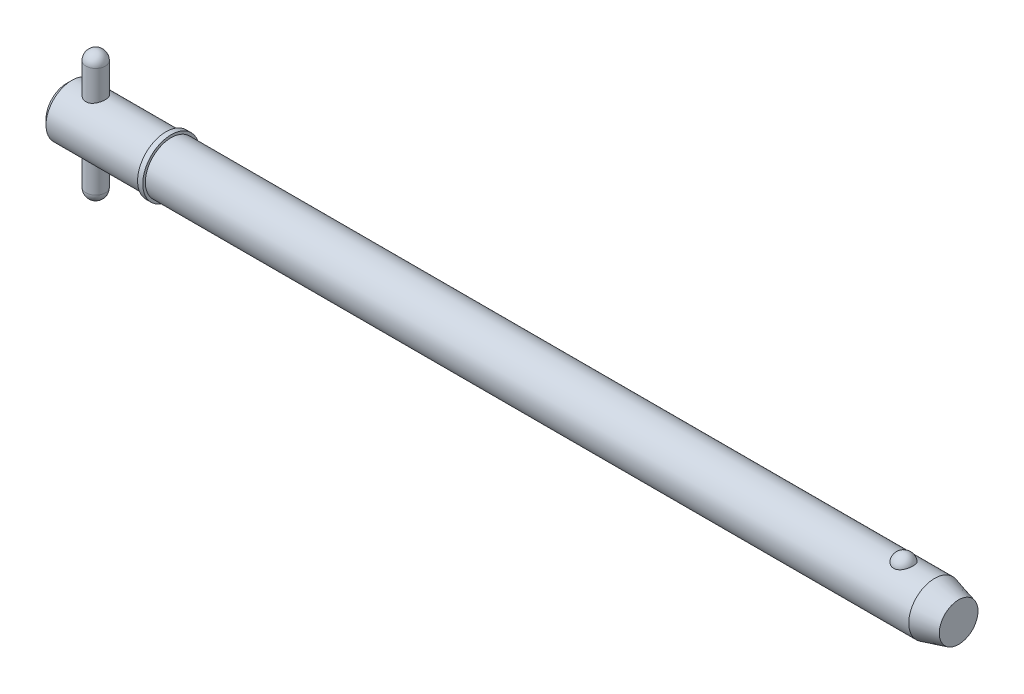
ISO-10303-21;
HEADER;
FILE_DESCRIPTION(('STEP AP214'),'2;1');
FILE_NAME('part.step','',(''),(''),'','','');
FILE_SCHEMA(('AUTOMOTIVE_DESIGN { 1 0 10303 214 1 1 1 1 }'));
ENDSEC;
DATA;
#1=APPLICATION_CONTEXT('core data for automotive mechanical design processes');
#2=APPLICATION_PROTOCOL_DEFINITION('international standard','automotive_design',2000,#1);
#3=PRODUCT_CONTEXT('',#1,'mechanical');
#4=PRODUCT('Part','Part','',(#3));
#5=PRODUCT_RELATED_PRODUCT_CATEGORY('part','',(#4));
#6=PRODUCT_DEFINITION_FORMATION('','',#4);
#7=PRODUCT_DEFINITION_CONTEXT('part definition',#1,'design');
#8=PRODUCT_DEFINITION('design','',#6,#7);
#9=PRODUCT_DEFINITION_SHAPE('','',#8);
#10=(LENGTH_UNIT() NAMED_UNIT(*) SI_UNIT(.MILLI.,.METRE.));
#11=(NAMED_UNIT(*) PLANE_ANGLE_UNIT() SI_UNIT($,.RADIAN.));
#12=(NAMED_UNIT(*) SI_UNIT($,.STERADIAN.) SOLID_ANGLE_UNIT());
#13=UNCERTAINTY_MEASURE_WITH_UNIT(LENGTH_MEASURE(1.E-05),#10,'distance_accuracy_value','');
#14=(GEOMETRIC_REPRESENTATION_CONTEXT(3) GLOBAL_UNCERTAINTY_ASSIGNED_CONTEXT((#13)) GLOBAL_UNIT_ASSIGNED_CONTEXT((#10,
#11,#12)) REPRESENTATION_CONTEXT('',''));
#15=CARTESIAN_POINT('',(0.,0.,0.));
#16=DIRECTION('',(0.,0.,1.));
#17=DIRECTION('',(1.,0.,0.));
#18=AXIS2_PLACEMENT_3D('',#15,#16,#17);
#19=CARTESIAN_POINT('',(7.14,15.875,0.));
#20=DIRECTION('',(0.,-1.,0.));
#21=DIRECTION('',(0.,0.,-1.));
#22=AXIS2_PLACEMENT_3D('',#19,#20,#21);
#23=CYLINDRICAL_SURFACE('',#22,2.38);
#24=CARTESIAN_POINT('',(7.14,-13.495,0.));
#25=DIRECTION('',(0.,-1.,0.));
#26=DIRECTION('',(0.,0.,-1.));
#27=AXIS2_PLACEMENT_3D('',#24,#25,#26);
#28=CIRCLE('',#27,2.38);
#29=CARTESIAN_POINT('',(7.14,-13.495,-2.38));
#30=VERTEX_POINT('',#29);
#31=EDGE_CURVE('P0_E10',#30,#30,#28,.F.);
#32=ORIENTED_EDGE('',*,*,#31,.T.);
#33=EDGE_LOOP('',(#32));
#34=FACE_BOUND('',#33,.T.);
#35=CARTESIAN_POINT('',(7.14,13.495,0.));
#36=DIRECTION('',(0.,-1.,0.));
#37=DIRECTION('',(0.,0.,-1.));
#38=AXIS2_PLACEMENT_3D('',#35,#36,#37);
#39=CIRCLE('',#38,2.38);
#40=CARTESIAN_POINT('',(7.14,13.495,-2.38));
#41=VERTEX_POINT('',#40);
#42=EDGE_CURVE('P0_E21',#41,#41,#39,.T.);
#43=ORIENTED_EDGE('',*,*,#42,.T.);
#44=EDGE_LOOP('',(#43));
#45=FACE_BOUND('',#44,.T.);
#46=ADVANCED_FACE('P0_F14',(#34,#45),#23,.T.);
#47=CARTESIAN_POINT('',(7.14,-13.495,0.));
#48=DIRECTION('',(0.,0.,1.));
#49=DIRECTION('',(1.,0.,0.));
#50=AXIS2_PLACEMENT_3D('',#47,#48,#49);
#51=SPHERICAL_SURFACE('',#50,2.38);
#52=CARTESIAN_POINT('',(7.14,-13.495,0.));
#53=DIRECTION('',(0.,-1.,0.));
#54=DIRECTION('',(0.,0.,-1.));
#55=AXIS2_PLACEMENT_3D('',#52,#53,#54);
#56=SPHERICAL_SURFACE('',#55,2.38);
#57=ORIENTED_EDGE('',*,*,#31,.F.);
#58=EDGE_LOOP('',(#57));
#59=FACE_BOUND('',#58,.T.);
#60=ADVANCED_FACE('P0_F29',(#59),#56,.T.);
#61=CARTESIAN_POINT('',(7.14,13.495,0.));
#62=DIRECTION('',(0.,0.,1.));
#63=DIRECTION('',(1.,0.,0.));
#64=AXIS2_PLACEMENT_3D('',#61,#62,#63);
#65=SPHERICAL_SURFACE('',#64,2.38);
#66=CARTESIAN_POINT('',(7.14,13.495,0.));
#67=DIRECTION('',(0.,-1.,0.));
#68=DIRECTION('',(0.,0.,-1.));
#69=AXIS2_PLACEMENT_3D('',#66,#67,#68);
#70=SPHERICAL_SURFACE('',#69,2.38);
#71=ORIENTED_EDGE('',*,*,#42,.F.);
#72=EDGE_LOOP('',(#71));
#73=FACE_BOUND('',#72,.T.);
#74=ADVANCED_FACE('P0_F16',(#73),#70,.T.);
#75=CLOSED_SHELL('',(#46,#60,#74));
#76=MANIFOLD_SOLID_BREP('P0_B1',#75);
#77=CARTESIAN_POINT('',(0.,0.,0.));
#78=DIRECTION('',(1.,0.,0.));
#79=DIRECTION('',(0.,0.,-1.));
#80=AXIS2_PLACEMENT_3D('',#77,#78,#79);
#81=CYLINDRICAL_SURFACE('',#80,6.35);
#82=CARTESIAN_POINT('',(213.455369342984,0.,0.));
#83=DIRECTION('',(1.,0.,0.));
#84=DIRECTION('',(0.,0.,-1.));
#85=AXIS2_PLACEMENT_3D('',#82,#83,#84);
#86=CIRCLE('',#85,6.35);
#87=CARTESIAN_POINT('',(213.455369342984,0.,-6.35));
#88=VERTEX_POINT('',#87);
#89=EDGE_CURVE('P1_E81',#88,#88,#86,.T.);
#90=ORIENTED_EDGE('',*,*,#89,.F.);
#91=EDGE_LOOP('',(#90));
#92=FACE_BOUND('',#91,.T.);
#93=CARTESIAN_POINT('',(25.7,0.,0.));
#94=DIRECTION('',(1.,0.,0.));
#95=DIRECTION('',(0.,0.,-1.));
#96=AXIS2_PLACEMENT_3D('',#93,#94,#95);
#97=CIRCLE('',#96,6.35);
#98=CARTESIAN_POINT('',(25.7,0.,-6.35));
#99=VERTEX_POINT('',#98);
#100=EDGE_CURVE('P1_E85',#99,#99,#97,.T.);
#101=ORIENTED_EDGE('',*,*,#100,.T.);
#102=EDGE_LOOP('',(#101));
#103=FACE_BOUND('',#102,.T.);
#104=CARTESIAN_POINT('',(205.830021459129,5.87502187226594,2.40969251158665));
#105=CARTESIAN_POINT('',(205.705030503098,5.87501645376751,2.40969773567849));
#106=CARTESIAN_POINT('',(205.580080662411,5.87916061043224,2.39967292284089));
#107=CARTESIAN_POINT('',(205.333909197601,5.89523112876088,2.35991730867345));
#108=CARTESIAN_POINT('',(205.212686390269,5.90715499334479,2.33019283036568));
#109=CARTESIAN_POINT('',(204.977517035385,5.93739567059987,2.25201402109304));
#110=CARTESIAN_POINT('',(204.863560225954,5.95570321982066,2.20358681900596));
#111=CARTESIAN_POINT('',(204.64557352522,5.99672067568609,2.08937987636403));
#112=CARTESIAN_POINT('',(204.541545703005,6.0194314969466,2.02359652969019));
#113=CARTESIAN_POINT('',(204.342943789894,6.06760647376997,1.87428969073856));
#114=CARTESIAN_POINT('',(204.248726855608,6.09313095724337,1.79031110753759));
#115=CARTESIAN_POINT('',(204.075255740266,6.14375873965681,1.6080017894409));
#116=CARTESIAN_POINT('',(203.996004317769,6.16886196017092,1.50966841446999));
#117=CARTESIAN_POINT('',(203.850845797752,6.21724600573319,1.29645884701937));
#118=CARTESIAN_POINT('',(203.785688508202,6.24039621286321,1.1810415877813));
#119=CARTESIAN_POINT('',(203.674703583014,6.28117277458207,0.940351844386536));
#120=CARTESIAN_POINT('',(203.628877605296,6.29879865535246,0.815078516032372));
#121=CARTESIAN_POINT('',(203.557023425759,6.32692073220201,0.556494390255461));
#122=CARTESIAN_POINT('',(203.531249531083,6.33732517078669,0.423102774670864));
#123=CARTESIAN_POINT('',(203.500988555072,6.34957673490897,0.153542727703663));
#124=CARTESIAN_POINT('',(203.496500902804,6.35142408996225,0.0173743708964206));
#125=CARTESIAN_POINT('',(203.508865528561,6.34638925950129,-0.253036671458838));
#126=CARTESIAN_POINT('',(203.525594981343,6.33955731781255,-0.387285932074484));
#127=CARTESIAN_POINT('',(203.579843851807,6.31794129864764,-0.650851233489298));
#128=CARTESIAN_POINT('',(203.617363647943,6.3031570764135,-0.780167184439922));
#129=CARTESIAN_POINT('',(203.712500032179,6.26711642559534,-1.03041949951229));
#130=CARTESIAN_POINT('',(203.770143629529,6.24585130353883,-1.15134433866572));
#131=CARTESIAN_POINT('',(203.904352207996,6.19905619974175,-1.38129800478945));
#132=CARTESIAN_POINT('',(203.980918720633,6.17352587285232,-1.49032586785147));
#133=CARTESIAN_POINT('',(204.151753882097,6.12080227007,-1.69393164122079));
#134=CARTESIAN_POINT('',(204.246100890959,6.09360200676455,-1.78844209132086));
#135=CARTESIAN_POINT('',(204.450119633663,6.04070434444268,-1.95970536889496));
#136=CARTESIAN_POINT('',(204.559790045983,6.015006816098,-2.0364597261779));
#137=CARTESIAN_POINT('',(204.789187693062,5.96867714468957,-2.16845644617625));
#138=CARTESIAN_POINT('',(204.908652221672,5.94794910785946,-2.22412062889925));
#139=CARTESIAN_POINT('',(205.156218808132,5.91340580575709,-2.31440992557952));
#140=CARTESIAN_POINT('',(205.284317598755,5.89958794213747,-2.34904294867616));
#141=CARTESIAN_POINT('',(205.538582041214,5.88111049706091,-2.39491590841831));
#142=CARTESIAN_POINT('',(205.664520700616,5.87602512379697,-2.40724512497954));
#143=CARTESIAN_POINT('',(205.916786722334,5.87428980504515,-2.41147867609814));
#144=CARTESIAN_POINT('',(206.043114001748,5.8776381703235,-2.40338710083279));
#145=CARTESIAN_POINT('',(206.288417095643,5.89212921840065,-2.36762715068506));
#146=CARTESIAN_POINT('',(206.407499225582,5.90302431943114,-2.3405803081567));
#147=CARTESIAN_POINT('',(206.63924472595,5.93113752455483,-2.26839066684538));
#148=CARTESIAN_POINT('',(206.751907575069,5.94835614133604,-2.22324640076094));
#149=CARTESIAN_POINT('',(206.970400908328,5.9877301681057,-2.11493806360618));
#150=CARTESIAN_POINT('',(207.076028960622,6.00998499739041,-2.0514026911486));
#151=CARTESIAN_POINT('',(207.275300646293,6.05690144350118,-1.90842705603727));
#152=CARTESIAN_POINT('',(207.368941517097,6.08156361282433,-1.82898313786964));
#153=CARTESIAN_POINT('',(207.546675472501,6.13211715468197,-1.65182429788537));
#154=CARTESIAN_POINT('',(207.630055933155,6.15800825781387,-1.5533938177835));
#155=CARTESIAN_POINT('',(207.779790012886,6.20712834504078,-1.34374214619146));
#156=CARTESIAN_POINT('',(207.846140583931,6.23035685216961,-1.23251867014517));
#157=CARTESIAN_POINT('',(207.962345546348,6.27251177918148,-0.996447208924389));
#158=CARTESIAN_POINT('',(208.011607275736,6.29127762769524,-0.871278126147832));
#159=CARTESIAN_POINT('',(208.089614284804,6.3215862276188,-0.613870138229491));
#160=CARTESIAN_POINT('',(208.118359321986,6.33312889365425,-0.481631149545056));
#161=CARTESIAN_POINT('',(208.154770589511,6.34782349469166,-0.213672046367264));
#162=CARTESIAN_POINT('',(208.162413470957,6.35096613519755,-0.0779482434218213));
#163=CARTESIAN_POINT('',(208.156395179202,6.34851322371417,0.192943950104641));
#164=CARTESIAN_POINT('',(208.142734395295,6.3429178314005,0.328112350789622));
#165=CARTESIAN_POINT('',(208.09450361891,6.32360512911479,0.593406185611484));
#166=CARTESIAN_POINT('',(208.060031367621,6.30992579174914,0.723552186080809));
#167=CARTESIAN_POINT('',(207.970953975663,6.27586325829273,0.97583417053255));
#168=CARTESIAN_POINT('',(207.91634761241,6.25547965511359,1.09796966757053));
#169=CARTESIAN_POINT('',(207.78775879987,6.20998183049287,1.33148921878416));
#170=CARTESIAN_POINT('',(207.713674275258,6.18484288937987,1.44281227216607));
#171=CARTESIAN_POINT('',(207.547820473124,6.13258735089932,1.65087683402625));
#172=CARTESIAN_POINT('',(207.456051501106,6.10547078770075,1.74761859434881));
#173=CARTESIAN_POINT('',(207.257183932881,6.05235879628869,1.92350926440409));
#174=CARTESIAN_POINT('',(207.150133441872,6.02636017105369,2.00271146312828));
#175=CARTESIAN_POINT('',(206.923138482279,5.97843747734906,2.14154159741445));
#176=CARTESIAN_POINT('',(206.803191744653,5.9565141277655,2.20116608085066));
#177=CARTESIAN_POINT('',(206.544523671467,5.91812106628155,2.30250570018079));
#178=CARTESIAN_POINT('',(206.40506980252,5.90217533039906,2.34256795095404));
#179=CARTESIAN_POINT('',(206.120397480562,5.88063128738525,2.3961521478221));
#180=CARTESIAN_POINT('',(205.97518174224,5.87502816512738,2.40968644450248));
#181=CARTESIAN_POINT('',(205.830021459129,5.87502187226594,2.40969251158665));
#182=B_SPLINE_CURVE_WITH_KNOTS('',3,(#104,#105,#106,#107,#108,#109,#110,#111,#112,#113,#114,
#115,#116,#117,#118,#119,#120,#121,#122,#123,#124,#125,#126,#127,#128,#129,#130,#131,#132,#133,
#134,#135,#136,#137,#138,#139,#140,#141,#142,#143,#144,#145,#146,#147,#148,#149,#150,#151,#152,
#153,#154,#155,#156,#157,#158,#159,#160,#161,#162,#163,#164,#165,#166,#167,#168,#169,#170,#171,
#172,#173,#174,#175,#176,#177,#178,#179,#180,#181),.UNSPECIFIED.,.T.,.F.,(4,2,2,2,2,2,2,2,2,2,2,
2,2,2,2,2,2,2,2,2,2,2,2,2,2,2,2,2,2,2,2,2,2,2,2,2,2,2,4),(0.,0.374440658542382,
0.748761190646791,1.122540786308,1.4963981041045,1.88098871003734,2.26565013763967,
2.66741104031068,3.06920639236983,3.47601794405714,3.88281858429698,4.28727498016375,
4.69173873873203,5.09674745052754,5.50178895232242,5.90865911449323,6.31549420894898,
6.71369855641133,7.11175305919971,7.48978077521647,7.86773278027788,8.23383886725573,
8.59997464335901,8.97409044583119,9.34829231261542,9.74122667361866,10.1342313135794,
10.5397522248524,10.9452779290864,11.3512521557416,11.75721896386,12.1612938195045,
12.5653932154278,12.9716540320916,13.3779078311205,13.7829098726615,14.1879832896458,
14.6230486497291,15.0579114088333),.UNSPECIFIED.);
#183=CARTESIAN_POINT('',(205.830021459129,5.87502187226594,2.40969251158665));
#184=VERTEX_POINT('',#183);
#185=EDGE_CURVE('P1_E35',#184,#184,#182,.T.);
#186=ORIENTED_EDGE('',*,*,#185,.T.);
#187=EDGE_LOOP('',(#186));
#188=FACE_BOUND('',#187,.T.);
#189=ADVANCED_FACE('P1_F13',(#92,#103,#188),#81,.T.);
#190=CARTESIAN_POINT('',(0.,0.,0.));
#191=DIRECTION('',(-1.,0.,0.));
#192=DIRECTION('',(0.,0.,1.));
#193=AXIS2_PLACEMENT_3D('',#190,#191,#192);
#194=PLANE('',#193);
#195=CARTESIAN_POINT('',(0.,0.,0.));
#196=DIRECTION('',(1.,0.,0.));
#197=DIRECTION('',(0.,0.,-1.));
#198=AXIS2_PLACEMENT_3D('',#195,#196,#197);
#199=CIRCLE('',#198,5.08);
#200=CARTESIAN_POINT('',(0.,0.,-5.08));
#201=VERTEX_POINT('',#200);
#202=EDGE_CURVE('P1_E9',#201,#201,#199,.T.);
#203=ORIENTED_EDGE('',*,*,#202,.F.);
#204=EDGE_LOOP('',(#203));
#205=FACE_BOUND('',#204,.T.);
#206=ADVANCED_FACE('P1_F15',(#205),#194,.T.);
#207=CARTESIAN_POINT('',(1.27,0.,0.));
#208=DIRECTION('',(1.,0.,0.));
#209=DIRECTION('',(0.,0.,-1.));
#210=AXIS2_PLACEMENT_3D('',#207,#208,#209);
#211=CONICAL_SURFACE('',#210,6.35,0.78539816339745);
#212=ORIENTED_EDGE('',*,*,#202,.T.);
#213=EDGE_LOOP('',(#212));
#214=FACE_BOUND('',#213,.T.);
#215=CARTESIAN_POINT('',(1.27,0.,0.));
#216=DIRECTION('',(1.,0.,0.));
#217=DIRECTION('',(0.,0.,-1.));
#218=AXIS2_PLACEMENT_3D('',#215,#216,#217);
#219=CIRCLE('',#218,6.35);
#220=CARTESIAN_POINT('',(1.27,0.,-6.35));
#221=VERTEX_POINT('',#220);
#222=EDGE_CURVE('P1_E26',#221,#221,#219,.T.);
#223=ORIENTED_EDGE('',*,*,#222,.F.);
#224=EDGE_LOOP('',(#223));
#225=FACE_BOUND('',#224,.T.);
#226=ADVANCED_FACE('P1_F77',(#214,#225),#211,.T.);
#227=CARTESIAN_POINT('',(0.,0.,0.));
#228=DIRECTION('',(1.,0.,0.));
#229=DIRECTION('',(0.,0.,-1.));
#230=AXIS2_PLACEMENT_3D('',#227,#228,#229);
#231=CYLINDRICAL_SURFACE('',#230,6.35);
#232=CARTESIAN_POINT('',(7.14,-5.88711304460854,2.38));
#233=CARTESIAN_POINT('',(7.01146258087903,-5.88710856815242,2.38000480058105));
#234=CARTESIAN_POINT('',(6.88295682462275,-5.89136840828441,2.36955244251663));
#235=CARTESIAN_POINT('',(6.62981934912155,-5.90782785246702,2.32820953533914));
#236=CARTESIAN_POINT('',(6.50518751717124,-5.92002722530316,2.29731958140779));
#237=CARTESIAN_POINT('',(6.26352403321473,-5.95079384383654,2.21639366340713));
#238=CARTESIAN_POINT('',(6.14647496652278,-5.96934583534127,2.16640353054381));
#239=CARTESIAN_POINT('',(5.92237941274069,-6.01070278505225,2.04885862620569));
#240=CARTESIAN_POINT('',(5.81533593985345,-6.03350901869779,1.98129858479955));
#241=CARTESIAN_POINT('',(5.60897525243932,-6.08207341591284,1.82693902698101));
#242=CARTESIAN_POINT('',(5.51022503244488,-6.10791836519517,1.73940861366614));
#243=CARTESIAN_POINT('',(5.32840561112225,-6.15892405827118,1.54914379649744));
#244=CARTESIAN_POINT('',(5.24533975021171,-6.1840846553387,1.44640616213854));
#245=CARTESIAN_POINT('',(5.09451639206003,-6.23191821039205,1.22434014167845));
#246=CARTESIAN_POINT('',(5.02737511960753,-6.25447755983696,1.10456656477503));
#247=CARTESIAN_POINT('',(4.91443001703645,-6.2935236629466,0.854429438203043));
#248=CARTESIAN_POINT('',(4.86861879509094,-6.31001251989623,0.724069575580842));
#249=CARTESIAN_POINT('',(4.80162253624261,-6.33444370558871,0.46242122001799));
#250=CARTESIAN_POINT('',(4.77946137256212,-6.34272370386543,0.331414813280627));
#251=CARTESIAN_POINT('',(4.75726677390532,-6.35101600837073,0.0672982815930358));
#252=CARTESIAN_POINT('',(4.75722615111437,-6.35103100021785,-0.0658111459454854));
#253=CARTESIAN_POINT('',(4.77870510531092,-6.3430064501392,-0.323358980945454));
#254=CARTESIAN_POINT('',(4.79915922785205,-6.33536494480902,-0.447900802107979));
#255=CARTESIAN_POINT('',(4.85925493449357,-6.31340794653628,-0.69163609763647));
#256=CARTESIAN_POINT('',(4.89889787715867,-6.29909198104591,-0.810829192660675));
#257=CARTESIAN_POINT('',(4.9967414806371,-6.26494471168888,-1.04254212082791));
#258=CARTESIAN_POINT('',(5.05520370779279,-6.24503620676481,-1.1549396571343));
#259=CARTESIAN_POINT('',(5.1887948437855,-6.20171869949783,-1.3686079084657));
#260=CARTESIAN_POINT('',(5.26392912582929,-6.17830856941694,-1.46987502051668));
#261=CARTESIAN_POINT('',(5.43386591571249,-6.12878580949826,-1.66468415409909));
#262=CARTESIAN_POINT('',(5.52956139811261,-6.10259519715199,-1.75742857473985));
#263=CARTESIAN_POINT('',(5.73530435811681,-6.05155777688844,-1.92585331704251));
#264=CARTESIAN_POINT('',(5.84535542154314,-6.02671130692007,-2.00152936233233));
#265=CARTESIAN_POINT('',(6.07982989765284,-5.98068420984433,-2.13519109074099));
#266=CARTESIAN_POINT('',(6.20451768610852,-5.95959698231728,-2.19274775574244));
#267=CARTESIAN_POINT('',(6.4628145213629,-5.92455622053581,-2.28574558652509));
#268=CARTESIAN_POINT('',(6.59641856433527,-5.91059872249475,-2.32119904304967));
#269=CARTESIAN_POINT('',(6.86087441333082,-5.8923327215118,-2.36717069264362));
#270=CARTESIAN_POINT('',(6.99147192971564,-5.8875347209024,-2.37895573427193));
#271=CARTESIAN_POINT('',(7.25283805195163,-5.88674545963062,-2.38091046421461));
#272=CARTESIAN_POINT('',(7.38360660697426,-5.89075200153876,-2.37108554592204));
#273=CARTESIAN_POINT('',(7.63510696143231,-5.90662331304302,-2.33124781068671));
#274=CARTESIAN_POINT('',(7.75602069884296,-5.91810660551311,-2.30221396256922));
#275=CARTESIAN_POINT('',(7.99120505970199,-5.94718527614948,-2.22601401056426));
#276=CARTESIAN_POINT('',(8.10547431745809,-5.96478190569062,-2.17884419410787));
#277=CARTESIAN_POINT('',(8.32888632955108,-6.00491533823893,-2.06572311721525));
#278=CARTESIAN_POINT('',(8.43767672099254,-6.02761250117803,-1.99913452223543));
#279=CARTESIAN_POINT('',(8.6429894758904,-6.07511988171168,-1.84974438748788));
#280=CARTESIAN_POINT('',(8.73950733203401,-6.09993087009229,-1.76693691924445));
#281=CARTESIAN_POINT('',(8.9238741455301,-6.1507686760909,-1.58125563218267));
#282=CARTESIAN_POINT('',(9.01078732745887,-6.17677301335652,-1.47744327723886));
#283=CARTESIAN_POINT('',(9.16607127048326,-6.22556172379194,-1.25606967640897));
#284=CARTESIAN_POINT('',(9.23444197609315,-6.24834608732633,-1.13850838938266));
#285=CARTESIAN_POINT('',(9.3502493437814,-6.28811144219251,-0.893050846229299));
#286=CARTESIAN_POINT('',(9.39775808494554,-6.30511236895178,-0.765192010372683));
#287=CARTESIAN_POINT('',(9.47032640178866,-6.33145833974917,-0.502514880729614));
#288=CARTESIAN_POINT('',(9.49539651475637,-6.34080697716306,-0.367699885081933));
#289=CARTESIAN_POINT('',(9.52124059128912,-6.35045496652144,-0.103396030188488));
#290=CARTESIAN_POINT('',(9.52334421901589,-6.35124952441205,0.025945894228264));
#291=CARTESIAN_POINT('',(9.50661518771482,-6.34499064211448,0.283061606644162));
#292=CARTESIAN_POINT('',(9.48778504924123,-6.33793814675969,0.410835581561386));
#293=CARTESIAN_POINT('',(9.43065630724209,-6.31700307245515,0.658028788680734));
#294=CARTESIAN_POINT('',(9.39284291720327,-6.30329098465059,0.7775756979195));
#295=CARTESIAN_POINT('',(9.29930406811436,-6.27046903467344,1.00863789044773));
#296=CARTESIAN_POINT('',(9.2435752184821,-6.25135815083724,1.12015164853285));
#297=CARTESIAN_POINT('',(9.11312349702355,-6.20865254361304,1.33711407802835));
#298=CARTESIAN_POINT('',(9.03770094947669,-6.18490316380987,1.44211105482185));
#299=CARTESIAN_POINT('',(8.87110640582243,-6.13583718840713,1.63836897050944));
#300=CARTESIAN_POINT('',(8.77992879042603,-6.11052003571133,1.72962498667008));
#301=CARTESIAN_POINT('',(8.57869799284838,-6.05953829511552,1.90076098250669));
#302=CARTESIAN_POINT('',(8.46790320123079,-6.03392573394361,1.97978778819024));
#303=CARTESIAN_POINT('',(8.23379693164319,-5.98676607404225,2.11813466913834));
#304=CARTESIAN_POINT('',(8.11048418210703,-5.9652193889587,2.17745273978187));
#305=CARTESIAN_POINT('',(7.84900037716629,-5.92818393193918,2.27641807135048));
#306=CARTESIAN_POINT('',(7.71041678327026,-5.91299857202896,2.31510015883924));
#307=CARTESIAN_POINT('',(7.42787316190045,-5.89246887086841,2.36688002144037));
#308=CARTESIAN_POINT('',(7.28391673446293,-5.88711805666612,2.37999462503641));
#309=CARTESIAN_POINT('',(7.14,-5.88711304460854,2.38));
#310=B_SPLINE_CURVE_WITH_KNOTS('',3,(#232,#233,#234,#235,#236,#237,#238,#239,#240,#241,#242,
#243,#244,#245,#246,#247,#248,#249,#250,#251,#252,#253,#254,#255,#256,#257,#258,#259,#260,#261,
#262,#263,#264,#265,#266,#267,#268,#269,#270,#271,#272,#273,#274,#275,#276,#277,#278,#279,#280,
#281,#282,#283,#284,#285,#286,#287,#288,#289,#290,#291,#292,#293,#294,#295,#296,#297,#298,#299,
#300,#301,#302,#303,#304,#305,#306,#307,#308,#309),.UNSPECIFIED.,.T.,.F.,(4,2,2,2,2,2,2,2,2,2,2,
2,2,2,2,2,2,2,2,2,2,2,2,2,2,2,2,2,2,2,2,2,2,2,2,2,2,2,4),(0.,0.385076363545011,
0.770141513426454,1.15428843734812,1.53855071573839,1.94016118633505,2.3418570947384,
2.75720522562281,3.1724093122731,3.569721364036,3.96690431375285,4.34445758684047,
4.72203759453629,5.10511017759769,5.48830640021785,5.89390240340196,6.29959991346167,
6.71428455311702,7.12873839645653,7.52034494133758,7.91185376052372,8.28480528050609,
8.65783318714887,9.0448340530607,9.43197664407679,9.84363087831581,10.2552863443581,
10.6655081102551,11.0755371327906,11.4616919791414,11.847800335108,12.224507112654,
12.6012852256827,12.9938941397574,13.386643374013,13.8000944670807,14.2135876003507,
14.6450218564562,15.0761720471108),.UNSPECIFIED.);
#311=CARTESIAN_POINT('',(7.14,-5.88711304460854,2.38));
#312=VERTEX_POINT('',#311);
#313=EDGE_CURVE('P1_E17',#312,#312,#310,.T.);
#314=ORIENTED_EDGE('',*,*,#313,.F.);
#315=EDGE_LOOP('',(#314));
#316=FACE_BOUND('',#315,.T.);
#317=CARTESIAN_POINT('',(7.14,5.88711304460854,2.38));
#318=CARTESIAN_POINT('',(7.26853741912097,5.88710856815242,2.38000480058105));
#319=CARTESIAN_POINT('',(7.39704317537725,5.89136840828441,2.36955244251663));
#320=CARTESIAN_POINT('',(7.65018065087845,5.90782785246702,2.32820953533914));
#321=CARTESIAN_POINT('',(7.77481248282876,5.92002722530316,2.29731958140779));
#322=CARTESIAN_POINT('',(8.01647596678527,5.95079384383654,2.21639366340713));
#323=CARTESIAN_POINT('',(8.13352503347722,5.96934583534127,2.16640353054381));
#324=CARTESIAN_POINT('',(8.35762058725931,6.01070278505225,2.04885862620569));
#325=CARTESIAN_POINT('',(8.46466406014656,6.03350901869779,1.98129858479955));
#326=CARTESIAN_POINT('',(8.67102474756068,6.08207341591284,1.82693902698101));
#327=CARTESIAN_POINT('',(8.76977496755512,6.10791836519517,1.73940861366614));
#328=CARTESIAN_POINT('',(8.95159438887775,6.15892405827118,1.54914379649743));
#329=CARTESIAN_POINT('',(9.03466024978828,6.1840846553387,1.44640616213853));
#330=CARTESIAN_POINT('',(9.18548360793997,6.23191821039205,1.22434014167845));
#331=CARTESIAN_POINT('',(9.25262488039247,6.25447755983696,1.10456656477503));
#332=CARTESIAN_POINT('',(9.36556998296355,6.2935236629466,0.854429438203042));
#333=CARTESIAN_POINT('',(9.41138120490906,6.31001251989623,0.72406957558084));
#334=CARTESIAN_POINT('',(9.47837746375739,6.33444370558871,0.462421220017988));
#335=CARTESIAN_POINT('',(9.50053862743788,6.34272370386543,0.331414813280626));
#336=CARTESIAN_POINT('',(9.52273322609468,6.35101600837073,0.0672982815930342));
#337=CARTESIAN_POINT('',(9.52277384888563,6.35103100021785,-0.0658111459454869));
#338=CARTESIAN_POINT('',(9.50129489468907,6.3430064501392,-0.323358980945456));
#339=CARTESIAN_POINT('',(9.48084077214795,6.33536494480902,-0.447900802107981));
#340=CARTESIAN_POINT('',(9.42074506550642,6.31340794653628,-0.691636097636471));
#341=CARTESIAN_POINT('',(9.38110212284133,6.29909198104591,-0.810829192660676));
#342=CARTESIAN_POINT('',(9.2832585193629,6.26494471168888,-1.04254212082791));
#343=CARTESIAN_POINT('',(9.22479629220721,6.24503620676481,-1.1549396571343));
#344=CARTESIAN_POINT('',(9.0912051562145,6.20171869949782,-1.3686079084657));
#345=CARTESIAN_POINT('',(9.0160708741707,6.17830856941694,-1.46987502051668));
#346=CARTESIAN_POINT('',(8.84613408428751,6.12878580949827,-1.66468415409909));
#347=CARTESIAN_POINT('',(8.75043860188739,6.10259519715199,-1.75742857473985));
#348=CARTESIAN_POINT('',(8.54469564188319,6.05155777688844,-1.92585331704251));
#349=CARTESIAN_POINT('',(8.43464457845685,6.02671130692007,-2.00152936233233));
#350=CARTESIAN_POINT('',(8.20017010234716,5.98068420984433,-2.13519109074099));
#351=CARTESIAN_POINT('',(8.07548231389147,5.95959698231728,-2.19274775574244));
#352=CARTESIAN_POINT('',(7.8171854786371,5.9245562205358,-2.28574558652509));
#353=CARTESIAN_POINT('',(7.68358143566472,5.91059872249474,-2.32119904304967));
#354=CARTESIAN_POINT('',(7.41912558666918,5.8923327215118,-2.36717069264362));
#355=CARTESIAN_POINT('',(7.28852807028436,5.8875347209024,-2.37895573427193));
#356=CARTESIAN_POINT('',(7.02716194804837,5.88674545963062,-2.38091046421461));
#357=CARTESIAN_POINT('',(6.89639339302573,5.89075200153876,-2.37108554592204));
#358=CARTESIAN_POINT('',(6.64489303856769,5.90662331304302,-2.33124781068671));
#359=CARTESIAN_POINT('',(6.52397930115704,5.91810660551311,-2.30221396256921));
#360=CARTESIAN_POINT('',(6.288794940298,5.94718527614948,-2.22601401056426));
#361=CARTESIAN_POINT('',(6.17452568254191,5.96478190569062,-2.17884419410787));
#362=CARTESIAN_POINT('',(5.95111367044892,6.00491533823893,-2.06572311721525));
#363=CARTESIAN_POINT('',(5.84232327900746,6.02761250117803,-1.99913452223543));
#364=CARTESIAN_POINT('',(5.6370105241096,6.07511988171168,-1.84974438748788));
#365=CARTESIAN_POINT('',(5.54049266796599,6.09993087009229,-1.76693691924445));
#366=CARTESIAN_POINT('',(5.3561258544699,6.1507686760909,-1.58125563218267));
#367=CARTESIAN_POINT('',(5.26921267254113,6.17677301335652,-1.47744327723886));
#368=CARTESIAN_POINT('',(5.11392872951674,6.22556172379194,-1.25606967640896));
#369=CARTESIAN_POINT('',(5.04555802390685,6.24834608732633,-1.13850838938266));
#370=CARTESIAN_POINT('',(4.9297506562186,6.28811144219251,-0.893050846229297));
#371=CARTESIAN_POINT('',(4.88224191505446,6.30511236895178,-0.76519201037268));
#372=CARTESIAN_POINT('',(4.80967359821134,6.33145833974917,-0.502514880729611));
#373=CARTESIAN_POINT('',(4.78460348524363,6.34080697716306,-0.36769988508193));
#374=CARTESIAN_POINT('',(4.75875940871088,6.35045496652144,-0.103396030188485));
#375=CARTESIAN_POINT('',(4.75665578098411,6.35124952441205,0.025945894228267));
#376=CARTESIAN_POINT('',(4.77338481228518,6.34499064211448,0.283061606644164));
#377=CARTESIAN_POINT('',(4.79221495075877,6.33793814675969,0.410835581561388));
#378=CARTESIAN_POINT('',(4.84934369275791,6.31700307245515,0.658028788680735));
#379=CARTESIAN_POINT('',(4.88715708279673,6.30329098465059,0.777575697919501));
#380=CARTESIAN_POINT('',(4.98069593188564,6.27046903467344,1.00863789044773));
#381=CARTESIAN_POINT('',(5.0364247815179,6.25135815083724,1.12015164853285));
#382=CARTESIAN_POINT('',(5.16687650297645,6.20865254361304,1.33711407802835));
#383=CARTESIAN_POINT('',(5.24229905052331,6.18490316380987,1.44211105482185));
#384=CARTESIAN_POINT('',(5.40889359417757,6.13583718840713,1.63836897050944));
#385=CARTESIAN_POINT('',(5.50007120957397,6.11052003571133,1.72962498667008));
#386=CARTESIAN_POINT('',(5.70130200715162,6.05953829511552,1.90076098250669));
#387=CARTESIAN_POINT('',(5.81209679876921,6.03392573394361,1.97978778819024));
#388=CARTESIAN_POINT('',(6.04620306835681,5.98676607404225,2.11813466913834));
#389=CARTESIAN_POINT('',(6.16951581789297,5.9652193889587,2.17745273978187));
#390=CARTESIAN_POINT('',(6.43099962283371,5.92818393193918,2.27641807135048));
#391=CARTESIAN_POINT('',(6.56958321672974,5.91299857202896,2.31510015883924));
#392=CARTESIAN_POINT('',(6.85212683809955,5.89246887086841,2.36688002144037));
#393=CARTESIAN_POINT('',(6.99608326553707,5.88711805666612,2.37999462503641));
#394=CARTESIAN_POINT('',(7.14,5.88711304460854,2.38));
#395=B_SPLINE_CURVE_WITH_KNOTS('',3,(#317,#318,#319,#320,#321,#322,#323,#324,#325,#326,#327,
#328,#329,#330,#331,#332,#333,#334,#335,#336,#337,#338,#339,#340,#341,#342,#343,#344,#345,#346,
#347,#348,#349,#350,#351,#352,#353,#354,#355,#356,#357,#358,#359,#360,#361,#362,#363,#364,#365,
#366,#367,#368,#369,#370,#371,#372,#373,#374,#375,#376,#377,#378,#379,#380,#381,#382,#383,#384,
#385,#386,#387,#388,#389,#390,#391,#392,#393,#394),.UNSPECIFIED.,.T.,.F.,(4,2,2,2,2,2,2,2,2,2,2,
2,2,2,2,2,2,2,2,2,2,2,2,2,2,2,2,2,2,2,2,2,2,2,2,2,2,2,4),(0.,0.385076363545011,
0.770141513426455,1.15428843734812,1.53855071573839,1.94016118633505,2.3418570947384,
2.75720522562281,3.1724093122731,3.56972136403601,3.96690431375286,4.34445758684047,
4.72203759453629,5.10511017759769,5.48830640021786,5.89390240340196,6.29959991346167,
6.71428455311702,7.12873839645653,7.52034494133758,7.91185376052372,8.2848052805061,
8.65783318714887,9.0448340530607,9.43197664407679,9.84363087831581,10.2552863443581,
10.6655081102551,11.0755371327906,11.4616919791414,11.847800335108,12.2245071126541,
12.6012852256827,12.9938941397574,13.386643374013,13.8000944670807,14.2135876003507,
14.6450218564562,15.0761720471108),.UNSPECIFIED.);
#396=CARTESIAN_POINT('',(7.14,5.88711304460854,2.38));
#397=VERTEX_POINT('',#396);
#398=EDGE_CURVE('P1_E43',#397,#397,#395,.T.);
#399=ORIENTED_EDGE('',*,*,#398,.F.);
#400=EDGE_LOOP('',(#399));
#401=FACE_BOUND('',#400,.T.);
#402=ORIENTED_EDGE('',*,*,#222,.T.);
#403=EDGE_LOOP('',(#402));
#404=FACE_BOUND('',#403,.T.);
#405=CARTESIAN_POINT('',(24.43,0.,0.));
#406=DIRECTION('',(1.,0.,0.));
#407=DIRECTION('',(0.,0.,-1.));
#408=AXIS2_PLACEMENT_3D('',#405,#406,#407);
#409=CIRCLE('',#408,6.35);
#410=CARTESIAN_POINT('',(24.43,0.,-6.35));
#411=VERTEX_POINT('',#410);
#412=EDGE_CURVE('P1_E31',#411,#411,#409,.T.);
#413=ORIENTED_EDGE('',*,*,#412,.F.);
#414=EDGE_LOOP('',(#413));
#415=FACE_BOUND('',#414,.T.);
#416=ADVANCED_FACE('P1_F103',(#316,#401,#404,#415),#231,.T.);
#417=CARTESIAN_POINT('',(24.43,6.35,0.));
#418=DIRECTION('',(-1.,0.,0.));
#419=DIRECTION('',(0.,0.,1.));
#420=AXIS2_PLACEMENT_3D('',#417,#418,#419);
#421=PLANE('',#420);
#422=ORIENTED_EDGE('',*,*,#412,.T.);
#423=EDGE_LOOP('',(#422));
#424=FACE_BOUND('',#423,.T.);
#425=CARTESIAN_POINT('',(24.43,0.,0.));
#426=DIRECTION('',(1.,0.,0.));
#427=DIRECTION('',(0.,0.,-1.));
#428=AXIS2_PLACEMENT_3D('',#425,#426,#427);
#429=CIRCLE('',#428,6.985);
#430=CARTESIAN_POINT('',(24.43,0.,-6.985));
#431=VERTEX_POINT('',#430);
#432=EDGE_CURVE('P1_E91',#431,#431,#429,.T.);
#433=ORIENTED_EDGE('',*,*,#432,.F.);
#434=EDGE_LOOP('',(#433));
#435=FACE_BOUND('',#434,.T.);
#436=ADVANCED_FACE('P1_F100',(#424,#435),#421,.T.);
#437=CARTESIAN_POINT('',(0.,0.,0.));
#438=DIRECTION('',(1.,0.,0.));
#439=DIRECTION('',(0.,0.,-1.));
#440=AXIS2_PLACEMENT_3D('',#437,#438,#439);
#441=CYLINDRICAL_SURFACE('',#440,6.985);
#442=ORIENTED_EDGE('',*,*,#432,.T.);
#443=EDGE_LOOP('',(#442));
#444=FACE_BOUND('',#443,.T.);
#445=CARTESIAN_POINT('',(25.7,0.,0.));
#446=DIRECTION('',(1.,0.,0.));
#447=DIRECTION('',(0.,0.,-1.));
#448=AXIS2_PLACEMENT_3D('',#445,#446,#447);
#449=CIRCLE('',#448,6.985);
#450=CARTESIAN_POINT('',(25.7,0.,-6.985));
#451=VERTEX_POINT('',#450);
#452=EDGE_CURVE('P1_E88',#451,#451,#449,.T.);
#453=ORIENTED_EDGE('',*,*,#452,.F.);
#454=EDGE_LOOP('',(#453));
#455=FACE_BOUND('',#454,.T.);
#456=ADVANCED_FACE('P1_F68',(#444,#455),#441,.T.);
#457=CARTESIAN_POINT('',(25.7,6.985,0.));
#458=DIRECTION('',(1.,0.,0.));
#459=DIRECTION('',(0.,0.,-1.));
#460=AXIS2_PLACEMENT_3D('',#457,#458,#459);
#461=PLANE('',#460);
#462=ORIENTED_EDGE('',*,*,#452,.T.);
#463=EDGE_LOOP('',(#462));
#464=FACE_BOUND('',#463,.T.);
#465=ORIENTED_EDGE('',*,*,#100,.F.);
#466=EDGE_LOOP('',(#465));
#467=FACE_BOUND('',#466,.T.);
#468=ADVANCED_FACE('P1_F62',(#464,#467),#461,.T.);
#469=CARTESIAN_POINT('',(219.38,0.,0.));
#470=DIRECTION('',(-1.,0.,0.));
#471=DIRECTION('',(0.,0.,1.));
#472=AXIS2_PLACEMENT_3D('',#469,#470,#471);
#473=CONICAL_SURFACE('',#472,4.76250000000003,0.261799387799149);
#474=ORIENTED_EDGE('',*,*,#89,.T.);
#475=EDGE_LOOP('',(#474));
#476=FACE_BOUND('',#475,.T.);
#477=CARTESIAN_POINT('',(219.38,0.,0.));
#478=DIRECTION('',(1.,0.,0.));
#479=DIRECTION('',(0.,0.,-1.));
#480=AXIS2_PLACEMENT_3D('',#477,#478,#479);
#481=CIRCLE('',#480,4.76250000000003);
#482=CARTESIAN_POINT('',(219.38,0.,-4.76250000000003));
#483=VERTEX_POINT('',#482);
#484=EDGE_CURVE('P1_E42',#483,#483,#481,.T.);
#485=ORIENTED_EDGE('',*,*,#484,.F.);
#486=EDGE_LOOP('',(#485));
#487=FACE_BOUND('',#486,.T.);
#488=ADVANCED_FACE('P1_F59',(#476,#487),#473,.T.);
#489=CARTESIAN_POINT('',(219.38,4.76250000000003,0.));
#490=DIRECTION('',(1.,0.,0.));
#491=DIRECTION('',(0.,0.,-1.));
#492=AXIS2_PLACEMENT_3D('',#489,#490,#491);
#493=PLANE('',#492);
#494=ORIENTED_EDGE('',*,*,#484,.T.);
#495=EDGE_LOOP('',(#494));
#496=FACE_BOUND('',#495,.T.);
#497=ADVANCED_FACE('P1_F55',(#496),#493,.T.);
#498=CARTESIAN_POINT('',(205.830021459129,5.715,0.));
#499=DIRECTION('',(-1.,0.,0.));
#500=DIRECTION('',(0.,1.,0.));
#501=AXIS2_PLACEMENT_3D('',#498,#499,#500);
#502=SPHERICAL_SURFACE('',#501,2.41500000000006);
#503=ORIENTED_EDGE('',*,*,#185,.F.);
#504=EDGE_LOOP('',(#503));
#505=FACE_BOUND('',#504,.T.);
#506=ADVANCED_FACE('P1_F50',(#505),#502,.T.);
#507=CARTESIAN_POINT('',(7.14,-6.985,0.));
#508=DIRECTION('',(0.,1.,0.));
#509=DIRECTION('',(0.,0.,1.));
#510=AXIS2_PLACEMENT_3D('',#507,#508,#509);
#511=CYLINDRICAL_SURFACE('',#510,2.38);
#512=ORIENTED_EDGE('',*,*,#313,.T.);
#513=EDGE_LOOP('',(#512));
#514=FACE_BOUND('',#513,.T.);
#515=ORIENTED_EDGE('',*,*,#398,.T.);
#516=EDGE_LOOP('',(#515));
#517=FACE_BOUND('',#516,.T.);
#518=ADVANCED_FACE('P1_F54',(#514,#517),#511,.F.);
#519=CLOSED_SHELL('',(#189,#206,#226,#416,#436,#456,#468,#488,#497,#506,#518));
#520=MANIFOLD_SOLID_BREP('P1_B1',#519);
#521=ADVANCED_BREP_SHAPE_REPRESENTATION('',(#18,#76,#520),#14);
#522=SHAPE_DEFINITION_REPRESENTATION(#9,#521);
ENDSEC;
END-ISO-10303-21;
